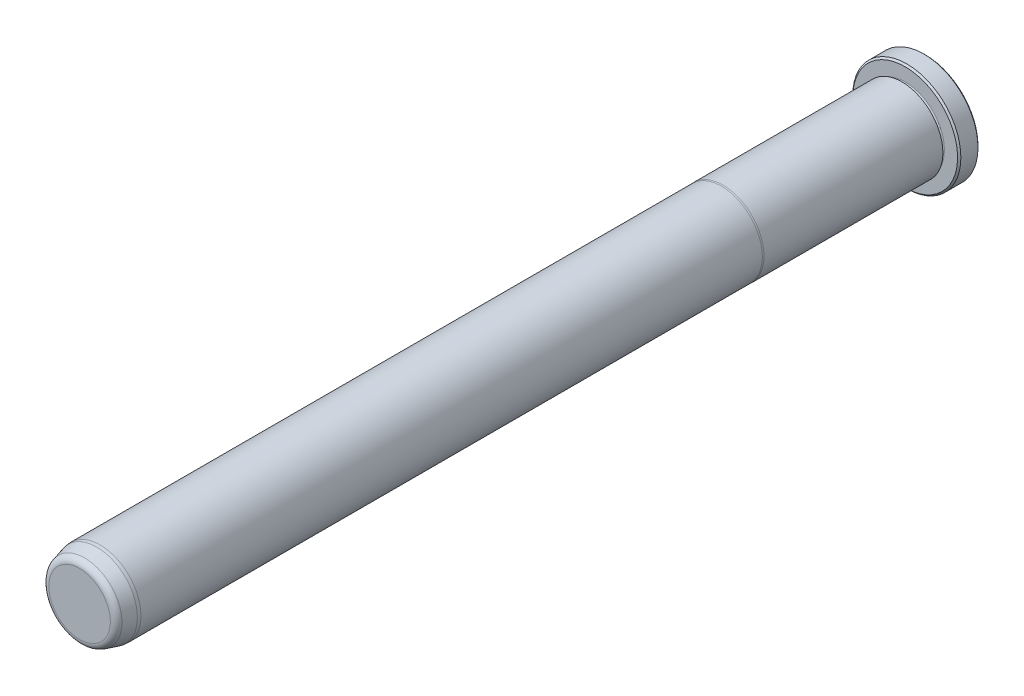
ISO-10303-21;
HEADER;
FILE_DESCRIPTION(('STEP AP214'),'2;1');
FILE_NAME('part.step','',(''),(''),'','','');
FILE_SCHEMA(('AUTOMOTIVE_DESIGN { 1 0 10303 214 1 1 1 1 }'));
ENDSEC;
DATA;
#1=APPLICATION_CONTEXT('core data for automotive mechanical design processes');
#2=APPLICATION_PROTOCOL_DEFINITION('international standard','automotive_design',2000,#1);
#3=PRODUCT_CONTEXT('',#1,'mechanical');
#4=PRODUCT('Part','Part','',(#3));
#5=PRODUCT_RELATED_PRODUCT_CATEGORY('part','',(#4));
#6=PRODUCT_DEFINITION_FORMATION('','',#4);
#7=PRODUCT_DEFINITION_CONTEXT('part definition',#1,'design');
#8=PRODUCT_DEFINITION('design','',#6,#7);
#9=PRODUCT_DEFINITION_SHAPE('','',#8);
#10=(LENGTH_UNIT() NAMED_UNIT(*) SI_UNIT(.MILLI.,.METRE.));
#11=(NAMED_UNIT(*) PLANE_ANGLE_UNIT() SI_UNIT($,.RADIAN.));
#12=(NAMED_UNIT(*) SI_UNIT($,.STERADIAN.) SOLID_ANGLE_UNIT());
#13=UNCERTAINTY_MEASURE_WITH_UNIT(LENGTH_MEASURE(1.E-05),#10,'distance_accuracy_value','');
#14=(GEOMETRIC_REPRESENTATION_CONTEXT(3) GLOBAL_UNCERTAINTY_ASSIGNED_CONTEXT((#13)) GLOBAL_UNIT_ASSIGNED_CONTEXT((#10,
#11,#12)) REPRESENTATION_CONTEXT('',''));
#15=CARTESIAN_POINT('',(0.,0.,0.));
#16=DIRECTION('',(0.,0.,1.));
#17=DIRECTION('',(1.,0.,0.));
#18=AXIS2_PLACEMENT_3D('',#15,#16,#17);
#19=CARTESIAN_POINT('',(0.,0.,0.));
#20=DIRECTION('',(0.,0.,1.));
#21=DIRECTION('',(1.,0.,0.));
#22=AXIS2_PLACEMENT_3D('',#19,#20,#21);
#23=PLANE('',#22);
#24=CARTESIAN_POINT('',(0.,0.,0.));
#25=DIRECTION('',(0.,0.,1.));
#26=DIRECTION('',(1.,0.,0.));
#27=AXIS2_PLACEMENT_3D('',#24,#25,#26);
#28=CIRCLE('',#27,12.192);
#29=CARTESIAN_POINT('',(12.192,0.,0.));
#30=VERTEX_POINT('',#29);
#31=EDGE_CURVE('E37',#30,#30,#28,.F.);
#32=ORIENTED_EDGE('',*,*,#31,.T.);
#33=EDGE_LOOP('',(#32));
#34=FACE_BOUND('',#33,.T.);
#35=ADVANCED_FACE('F30',(#34),#23,.F.);
#36=CARTESIAN_POINT('',(0.,0.,0.));
#37=DIRECTION('',(0.,0.,1.));
#38=DIRECTION('',(1.,0.,0.));
#39=AXIS2_PLACEMENT_3D('',#36,#37,#38);
#40=CYLINDRICAL_SURFACE('',#39,12.573);
#41=CARTESIAN_POINT('',(0.,0.,0.381000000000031));
#42=DIRECTION('',(0.,0.,1.));
#43=DIRECTION('',(1.,0.,0.));
#44=AXIS2_PLACEMENT_3D('',#41,#42,#43);
#45=CIRCLE('',#44,12.573);
#46=CARTESIAN_POINT('',(12.573,0.,0.381000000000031));
#47=VERTEX_POINT('',#46);
#48=EDGE_CURVE('E41',#47,#47,#45,.T.);
#49=ORIENTED_EDGE('',*,*,#48,.T.);
#50=EDGE_LOOP('',(#49));
#51=FACE_BOUND('',#50,.T.);
#52=CARTESIAN_POINT('',(0.,0.,4.36880000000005));
#53=DIRECTION('',(0.,0.,-1.));
#54=DIRECTION('',(-1.,0.,0.));
#55=AXIS2_PLACEMENT_3D('',#52,#53,#54);
#56=CIRCLE('',#55,12.573);
#57=CARTESIAN_POINT('',(-12.573,0.,4.36880000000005));
#58=VERTEX_POINT('',#57);
#59=EDGE_CURVE('E45',#58,#58,#56,.T.);
#60=ORIENTED_EDGE('',*,*,#59,.T.);
#61=EDGE_LOOP('',(#60));
#62=FACE_BOUND('',#61,.T.);
#63=ADVANCED_FACE('F118',(#51,#62),#40,.T.);
#64=CARTESIAN_POINT('',(0.,12.573,4.7498));
#65=DIRECTION('',(0.,0.,-1.));
#66=DIRECTION('',(-1.,0.,0.));
#67=AXIS2_PLACEMENT_3D('',#64,#65,#66);
#68=PLANE('',#67);
#69=CARTESIAN_POINT('',(0.,0.,4.7498));
#70=DIRECTION('',(0.,0.,-1.));
#71=DIRECTION('',(-1.,0.,0.));
#72=AXIS2_PLACEMENT_3D('',#69,#70,#71);
#73=CIRCLE('',#72,12.192);
#74=CARTESIAN_POINT('',(-12.192,0.,4.7498));
#75=VERTEX_POINT('',#74);
#76=EDGE_CURVE('E10',#75,#75,#73,.F.);
#77=ORIENTED_EDGE('',*,*,#76,.T.);
#78=EDGE_LOOP('',(#77));
#79=FACE_BOUND('',#78,.T.);
#80=CARTESIAN_POINT('',(0.,0.,4.7498));
#81=DIRECTION('',(0.,0.,1.));
#82=DIRECTION('',(1.,0.,0.));
#83=AXIS2_PLACEMENT_3D('',#80,#81,#82);
#84=CIRCLE('',#83,9.1313);
#85=CARTESIAN_POINT('',(9.1313,0.,4.7498));
#86=VERTEX_POINT('',#85);
#87=EDGE_CURVE('E56',#86,#86,#84,.T.);
#88=ORIENTED_EDGE('',*,*,#87,.F.);
#89=EDGE_LOOP('',(#88));
#90=FACE_BOUND('',#89,.T.);
#91=ADVANCED_FACE('F113',(#79,#90),#68,.F.);
#92=CARTESIAN_POINT('',(0.,0.,5.1308));
#93=DIRECTION('',(0.,0.,1.));
#94=DIRECTION('',(1.,0.,0.));
#95=AXIS2_PLACEMENT_3D('',#92,#93,#94);
#96=TOROIDAL_SURFACE('',#95,9.1313,0.381);
#97=CARTESIAN_POINT('',(0.,0.,5.5118));
#98=DIRECTION('',(0.,0.,1.));
#99=DIRECTION('',(1.,0.,0.));
#100=AXIS2_PLACEMENT_3D('',#97,#98,#99);
#101=CIRCLE('',#100,9.1313);
#102=CARTESIAN_POINT('',(9.1313,0.,5.5118));
#103=VERTEX_POINT('',#102);
#104=EDGE_CURVE('E59',#103,#103,#101,.T.);
#105=ORIENTED_EDGE('',*,*,#104,.F.);
#106=EDGE_LOOP('',(#105));
#107=FACE_BOUND('',#106,.T.);
#108=ORIENTED_EDGE('',*,*,#87,.T.);
#109=EDGE_LOOP('',(#108));
#110=FACE_BOUND('',#109,.T.);
#111=ADVANCED_FACE('F107',(#107,#110),#96,.F.);
#112=CARTESIAN_POINT('',(0.,9.1313,5.5118));
#113=DIRECTION('',(0.,0.,1.));
#114=DIRECTION('',(1.,0.,0.));
#115=AXIS2_PLACEMENT_3D('',#112,#113,#114);
#116=PLANE('',#115);
#117=CARTESIAN_POINT('',(0.,0.,5.5118));
#118=DIRECTION('',(0.,0.,1.));
#119=DIRECTION('',(1.,0.,0.));
#120=AXIS2_PLACEMENT_3D('',#117,#118,#119);
#121=CIRCLE('',#120,9.5377);
#122=CARTESIAN_POINT('',(9.5377,0.,5.5118));
#123=VERTEX_POINT('',#122);
#124=EDGE_CURVE('E62',#123,#123,#121,.T.);
#125=ORIENTED_EDGE('',*,*,#124,.F.);
#126=EDGE_LOOP('',(#125));
#127=FACE_BOUND('',#126,.T.);
#128=ORIENTED_EDGE('',*,*,#104,.T.);
#129=EDGE_LOOP('',(#128));
#130=FACE_BOUND('',#129,.T.);
#131=ADVANCED_FACE('F101',(#127,#130),#116,.F.);
#132=CARTESIAN_POINT('',(0.,0.,0.));
#133=DIRECTION('',(0.,0.,1.));
#134=DIRECTION('',(1.,0.,0.));
#135=AXIS2_PLACEMENT_3D('',#132,#133,#134);
#136=CYLINDRICAL_SURFACE('',#135,9.5377);
#137=CARTESIAN_POINT('',(0.,0.,47.1347630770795));
#138=DIRECTION('',(0.,0.,1.));
#139=DIRECTION('',(1.,0.,0.));
#140=AXIS2_PLACEMENT_3D('',#137,#138,#139);
#141=CIRCLE('',#140,9.53769999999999);
#142=CARTESIAN_POINT('',(9.53769999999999,0.,47.1347630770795));
#143=VERTEX_POINT('',#142);
#144=EDGE_CURVE('E65',#143,#143,#141,.T.);
#145=ORIENTED_EDGE('',*,*,#144,.F.);
#146=EDGE_LOOP('',(#145));
#147=FACE_BOUND('',#146,.T.);
#148=ORIENTED_EDGE('',*,*,#124,.T.);
#149=EDGE_LOOP('',(#148));
#150=FACE_BOUND('',#149,.T.);
#151=ADVANCED_FACE('F95',(#147,#150),#136,.T.);
#152=CARTESIAN_POINT('',(0.,0.,47.1347630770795));
#153=DIRECTION('',(0.,0.,-1.));
#154=DIRECTION('',(-1.,0.,0.));
#155=AXIS2_PLACEMENT_3D('',#152,#153,#154);
#156=CONICAL_SURFACE('',#155,9.53769999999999,0.0698131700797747);
#157=CARTESIAN_POINT('',(0.,0.,47.498));
#158=DIRECTION('',(0.,0.,1.));
#159=DIRECTION('',(1.,0.,0.));
#160=AXIS2_PLACEMENT_3D('',#157,#158,#159);
#161=CIRCLE('',#160,9.5123);
#162=CARTESIAN_POINT('',(9.5123,0.,47.498));
#163=VERTEX_POINT('',#162);
#164=EDGE_CURVE('E68',#163,#163,#161,.T.);
#165=ORIENTED_EDGE('',*,*,#164,.F.);
#166=EDGE_LOOP('',(#165));
#167=FACE_BOUND('',#166,.T.);
#168=ORIENTED_EDGE('',*,*,#144,.T.);
#169=EDGE_LOOP('',(#168));
#170=FACE_BOUND('',#169,.T.);
#171=ADVANCED_FACE('F89',(#167,#170),#156,.T.);
#172=CARTESIAN_POINT('',(0.,0.,0.));
#173=DIRECTION('',(0.,0.,1.));
#174=DIRECTION('',(1.,0.,0.));
#175=AXIS2_PLACEMENT_3D('',#172,#173,#174);
#176=CYLINDRICAL_SURFACE('',#175,9.51229999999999);
#177=CARTESIAN_POINT('',(0.,0.,192.0875));
#178=DIRECTION('',(0.,0.,1.));
#179=DIRECTION('',(1.,0.,0.));
#180=AXIS2_PLACEMENT_3D('',#177,#178,#179);
#181=CIRCLE('',#180,9.51229999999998);
#182=CARTESIAN_POINT('',(9.51229999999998,0.,192.0875));
#183=VERTEX_POINT('',#182);
#184=EDGE_CURVE('E71',#183,#183,#181,.T.);
#185=ORIENTED_EDGE('',*,*,#184,.F.);
#186=EDGE_LOOP('',(#185));
#187=FACE_BOUND('',#186,.T.);
#188=ORIENTED_EDGE('',*,*,#164,.T.);
#189=EDGE_LOOP('',(#188));
#190=FACE_BOUND('',#189,.T.);
#191=ADVANCED_FACE('F83',(#187,#190),#176,.T.);
#192=CARTESIAN_POINT('',(0.,0.,192.0875));
#193=DIRECTION('',(0.,0.,-1.));
#194=DIRECTION('',(-1.,0.,0.));
#195=AXIS2_PLACEMENT_3D('',#192,#193,#194);
#196=CONICAL_SURFACE('',#195,9.51229999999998,0.0872664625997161);
#197=CARTESIAN_POINT('',(0.,0.,192.8495));
#198=DIRECTION('',(0.,0.,1.));
#199=DIRECTION('',(1.,0.,0.));
#200=AXIS2_PLACEMENT_3D('',#197,#198,#199);
#201=CIRCLE('',#200,9.44563363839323);
#202=CARTESIAN_POINT('',(9.44563363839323,0.,192.8495));
#203=VERTEX_POINT('',#202);
#204=EDGE_CURVE('E74',#203,#203,#201,.T.);
#205=ORIENTED_EDGE('',*,*,#204,.F.);
#206=EDGE_LOOP('',(#205));
#207=FACE_BOUND('',#206,.T.);
#208=ORIENTED_EDGE('',*,*,#184,.T.);
#209=EDGE_LOOP('',(#208));
#210=FACE_BOUND('',#209,.T.);
#211=ADVANCED_FACE('F80',(#207,#210),#196,.T.);
#212=CARTESIAN_POINT('',(0.,0.,192.8495));
#213=DIRECTION('',(0.,0.,-1.));
#214=DIRECTION('',(-1.,0.,0.));
#215=AXIS2_PLACEMENT_3D('',#212,#213,#214);
#216=CONICAL_SURFACE('',#215,9.44563363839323,0.26179938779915);
#217=CARTESIAN_POINT('',(0.,0.,195.6733752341));
#218=DIRECTION('',(0.,0.,1.));
#219=DIRECTION('',(1.,0.,0.));
#220=AXIS2_PLACEMENT_3D('',#217,#218,#219);
#221=CIRCLE('',#220,8.68897854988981);
#222=CARTESIAN_POINT('',(8.68897854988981,0.,195.6733752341));
#223=VERTEX_POINT('',#222);
#224=EDGE_CURVE('E50',#223,#223,#221,.F.);
#225=ORIENTED_EDGE('',*,*,#224,.T.);
#226=EDGE_LOOP('',(#225));
#227=FACE_BOUND('',#226,.T.);
#228=ORIENTED_EDGE('',*,*,#204,.T.);
#229=EDGE_LOOP('',(#228));
#230=FACE_BOUND('',#229,.T.);
#231=ADVANCED_FACE('F78',(#227,#230),#216,.T.);
#232=CARTESIAN_POINT('',(0.,8.37370289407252,196.85));
#233=DIRECTION('',(0.,0.,-1.));
#234=DIRECTION('',(-1.,0.,0.));
#235=AXIS2_PLACEMENT_3D('',#232,#233,#234);
#236=PLANE('',#235);
#237=CARTESIAN_POINT('',(0.,0.,196.85));
#238=DIRECTION('',(0.,0.,-1.));
#239=DIRECTION('',(-1.,0.,0.));
#240=AXIS2_PLACEMENT_3D('',#237,#238,#239);
#241=CIRCLE('',#240,7.15557130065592);
#242=CARTESIAN_POINT('',(-7.15557130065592,0.,196.85));
#243=VERTEX_POINT('',#242);
#244=EDGE_CURVE('E53',#243,#243,#241,.F.);
#245=ORIENTED_EDGE('',*,*,#244,.T.);
#246=EDGE_LOOP('',(#245));
#247=FACE_BOUND('',#246,.T.);
#248=ADVANCED_FACE('F133',(#247),#236,.F.);
#249=CARTESIAN_POINT('',(0.,0.,195.2625));
#250=DIRECTION('',(0.,0.,-1.));
#251=DIRECTION('',(-1.,0.,0.));
#252=AXIS2_PLACEMENT_3D('',#249,#250,#251);
#253=TOROIDAL_SURFACE('',#252,7.15557130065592,1.5875);
#254=ORIENTED_EDGE('',*,*,#224,.F.);
#255=EDGE_LOOP('',(#254));
#256=FACE_BOUND('',#255,.T.);
#257=ORIENTED_EDGE('',*,*,#244,.F.);
#258=EDGE_LOOP('',(#257));
#259=FACE_BOUND('',#258,.T.);
#260=ADVANCED_FACE('F130',(#256,#259),#253,.T.);
#261=CARTESIAN_POINT('',(0.,0.,0.381000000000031));
#262=DIRECTION('',(0.,0.,1.));
#263=DIRECTION('',(1.,0.,0.));
#264=AXIS2_PLACEMENT_3D('',#261,#262,#263);
#265=CONICAL_SURFACE('',#264,12.573,0.785398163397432);
#266=CARTESIAN_POINT('',(12.192,0.,0.));
#267=CARTESIAN_POINT('',(12.19596875,0.,0.00396875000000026));
#268=CARTESIAN_POINT('',(12.1999375,0.,0.00793750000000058));
#269=CARTESIAN_POINT('',(12.207875,0.,0.0158750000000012));
#270=CARTESIAN_POINT('',(12.21184375,0.,0.0198437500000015));
#271=CARTESIAN_POINT('',(12.21978125,0.,0.0277812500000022));
#272=CARTESIAN_POINT('',(12.22375,0.,0.0317500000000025));
#273=CARTESIAN_POINT('',(12.2316875,0.,0.0396875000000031));
#274=CARTESIAN_POINT('',(12.23565625,0.,0.0436562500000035));
#275=CARTESIAN_POINT('',(12.24359375,0.,0.0515937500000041));
#276=CARTESIAN_POINT('',(12.2475625,0.,0.0555625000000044));
#277=CARTESIAN_POINT('',(12.2555,0.,0.0635000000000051));
#278=CARTESIAN_POINT('',(12.25946875,0.,0.0674687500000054));
#279=CARTESIAN_POINT('',(12.26740625,0.,0.075406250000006));
#280=CARTESIAN_POINT('',(12.271375,0.,0.0793750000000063));
#281=CARTESIAN_POINT('',(12.2793125,0.,0.087312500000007));
#282=CARTESIAN_POINT('',(12.28328125,0.,0.0912812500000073));
#283=CARTESIAN_POINT('',(12.29121875,0.,0.0992187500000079));
#284=CARTESIAN_POINT('',(12.2951875,0.,0.103187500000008));
#285=CARTESIAN_POINT('',(12.303125,0.,0.111125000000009));
#286=CARTESIAN_POINT('',(12.30709375,0.,0.115093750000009));
#287=CARTESIAN_POINT('',(12.31503125,0.,0.12303125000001));
#288=CARTESIAN_POINT('',(12.319,0.,0.12700000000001));
#289=CARTESIAN_POINT('',(12.3269375,0.,0.134937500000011));
#290=CARTESIAN_POINT('',(12.33090625,0.,0.138906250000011));
#291=CARTESIAN_POINT('',(12.33884375,0.,0.146843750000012));
#292=CARTESIAN_POINT('',(12.3428125,0.,0.150812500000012));
#293=CARTESIAN_POINT('',(12.35075,0.,0.158750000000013));
#294=CARTESIAN_POINT('',(12.35471875,0.,0.162718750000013));
#295=CARTESIAN_POINT('',(12.36265625,0.,0.170656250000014));
#296=CARTESIAN_POINT('',(12.366625,0.,0.174625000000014));
#297=CARTESIAN_POINT('',(12.3745625,0.,0.182562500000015));
#298=CARTESIAN_POINT('',(12.37853125,0.,0.186531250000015));
#299=CARTESIAN_POINT('',(12.38646875,0.,0.194468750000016));
#300=CARTESIAN_POINT('',(12.3904375,0.,0.198437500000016));
#301=CARTESIAN_POINT('',(12.398375,0.,0.206375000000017));
#302=CARTESIAN_POINT('',(12.40234375,0.,0.210343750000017));
#303=CARTESIAN_POINT('',(12.41028125,0.,0.218281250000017));
#304=CARTESIAN_POINT('',(12.41425,0.,0.222250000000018));
#305=CARTESIAN_POINT('',(12.4221875,0.,0.230187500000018));
#306=CARTESIAN_POINT('',(12.42615625,0.,0.234156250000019));
#307=CARTESIAN_POINT('',(12.43409375,0.,0.242093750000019));
#308=CARTESIAN_POINT('',(12.4380625,0.,0.24606250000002));
#309=CARTESIAN_POINT('',(12.446,0.,0.25400000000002));
#310=CARTESIAN_POINT('',(12.44996875,0.,0.257968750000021));
#311=CARTESIAN_POINT('',(12.45790625,0.,0.265906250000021));
#312=CARTESIAN_POINT('',(12.461875,0.,0.269875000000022));
#313=CARTESIAN_POINT('',(12.4698125,0.,0.277812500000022));
#314=CARTESIAN_POINT('',(12.47378125,0.,0.281781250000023));
#315=CARTESIAN_POINT('',(12.48171875,0.,0.289718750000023));
#316=CARTESIAN_POINT('',(12.4856875,0.,0.293687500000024));
#317=CARTESIAN_POINT('',(12.493625,0.,0.301625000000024));
#318=CARTESIAN_POINT('',(12.49759375,0.,0.305593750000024));
#319=CARTESIAN_POINT('',(12.50553125,0.,0.313531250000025));
#320=CARTESIAN_POINT('',(12.5095,0.,0.317500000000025));
#321=CARTESIAN_POINT('',(12.5174375,0.,0.325437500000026));
#322=CARTESIAN_POINT('',(12.52140625,0.,0.329406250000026));
#323=CARTESIAN_POINT('',(12.52934375,0.,0.337343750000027));
#324=CARTESIAN_POINT('',(12.5333125,0.,0.341312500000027));
#325=CARTESIAN_POINT('',(12.54125,0.,0.349250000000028));
#326=CARTESIAN_POINT('',(12.54521875,0.,0.353218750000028));
#327=CARTESIAN_POINT('',(12.55315625,0.,0.361156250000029));
#328=CARTESIAN_POINT('',(12.557125,0.,0.365125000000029));
#329=CARTESIAN_POINT('',(12.5650625,0.,0.37306250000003));
#330=CARTESIAN_POINT('',(12.56903125,0.,0.37703125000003));
#331=CARTESIAN_POINT('',(12.573,0.,0.381000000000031));
#332=B_SPLINE_CURVE_WITH_KNOTS('',3,(#266,#267,#268,#269,#270,#271,#272,#273,#274,#275,#276,
#277,#278,#279,#280,#281,#282,#283,#284,#285,#286,#287,#288,#289,#290,#291,#292,#293,#294,#295,
#296,#297,#298,#299,#300,#301,#302,#303,#304,#305,#306,#307,#308,#309,#310,#311,#312,#313,#314,
#315,#316,#317,#318,#319,#320,#321,#322,#323,#324,#325,#326,#327,#328,#329,#330,#331),
.UNSPECIFIED.,.F.,.F.,(4,2,2,2,2,2,2,2,2,2,2,2,2,2,2,2,2,2,2,2,2,2,2,2,2,2,2,2,2,2,2,2,4),(0.,
0.0168379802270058,0.0336759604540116,0.0505139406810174,0.0673519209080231,0.0841899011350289,
0.101027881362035,0.11786586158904,0.134703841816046,0.151541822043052,0.168379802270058,
0.185217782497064,0.202055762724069,0.218893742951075,0.235731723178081,0.252569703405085,
0.269407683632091,0.286245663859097,0.303083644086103,0.319921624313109,0.336759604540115,
0.35359758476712,0.370435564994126,0.387273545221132,0.404111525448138,0.420949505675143,
0.437787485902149,0.454625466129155,0.471463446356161,0.488301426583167,0.505139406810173,
0.521977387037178,0.538815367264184),.UNSPECIFIED.);
#333=EDGE_CURVE('BSEAM132',#30,#47,#332,.T.);
#334=ORIENTED_EDGE('',*,*,#31,.F.);
#335=ORIENTED_EDGE('',*,*,#48,.F.);
#336=ORIENTED_EDGE('',*,*,#333,.T.);
#337=ORIENTED_EDGE('',*,*,#333,.F.);
#338=EDGE_LOOP('',(#334,#336,#335,#337));
#339=FACE_BOUND('',#338,.T.);
#340=ADVANCED_FACE('F132',(#339),#265,.T.);
#341=CARTESIAN_POINT('',(0.,0.,4.7498));
#342=DIRECTION('',(0.,0.,-1.));
#343=DIRECTION('',(-1.,0.,0.));
#344=AXIS2_PLACEMENT_3D('',#341,#342,#343);
#345=CONICAL_SURFACE('',#344,12.192,0.785398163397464);
#346=ORIENTED_EDGE('',*,*,#59,.F.);
#347=EDGE_LOOP('',(#346));
#348=FACE_BOUND('',#347,.T.);
#349=ORIENTED_EDGE('',*,*,#76,.F.);
#350=EDGE_LOOP('',(#349));
#351=FACE_BOUND('',#350,.T.);
#352=ADVANCED_FACE('F32',(#348,#351),#345,.T.);
#353=CLOSED_SHELL('',(#35,#63,#91,#111,#131,#151,#171,#191,#211,#231,#248,#260,#340,#352));
#354=MANIFOLD_SOLID_BREP('B2',#353);
#355=ADVANCED_BREP_SHAPE_REPRESENTATION('',(#18,#354),#14);
#356=SHAPE_DEFINITION_REPRESENTATION(#9,#355);
ENDSEC;
END-ISO-10303-21;
